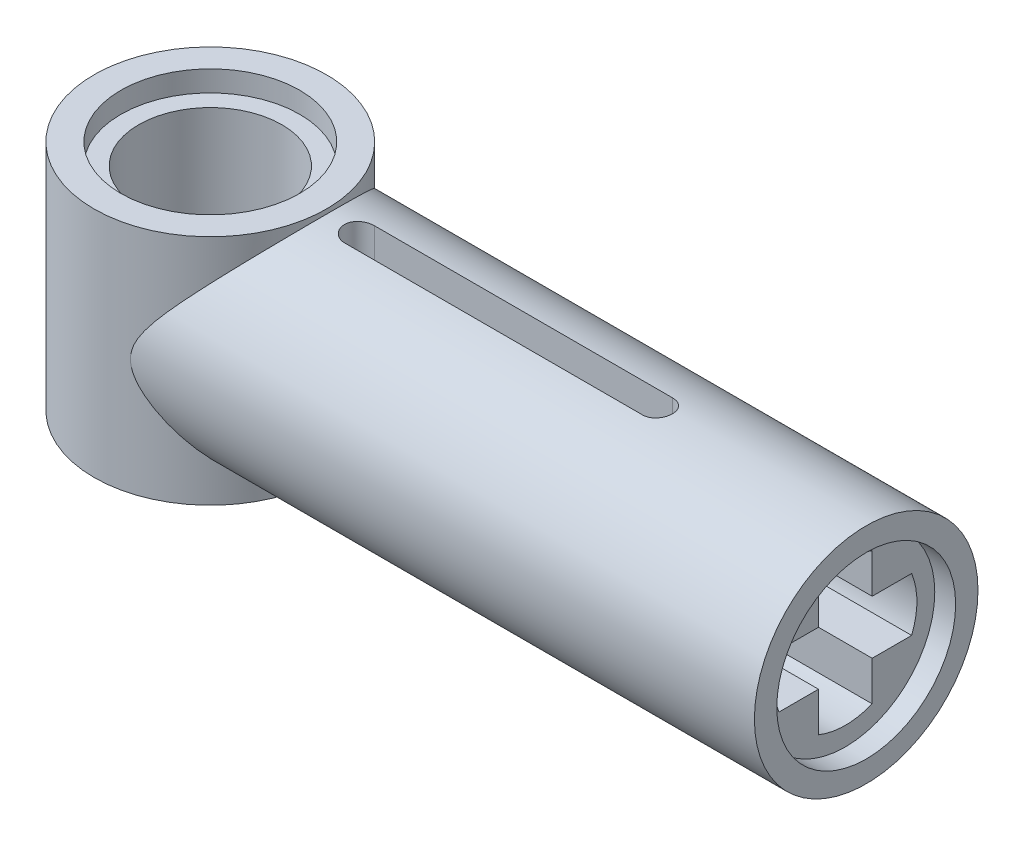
from build123d import *

# Parameters (mm, degrees)
SKETCH1_R                = 3.9
BOSS_EXTRUDE1_DEPTH      = 7.8
SKETCH2_R                = 3
CUT_EXTRUDE1_DEPTH       = 0.7
CUT_EXTRUDE2_START       = -0.7
SKETCH3_R                = 3
CUT_EXTRUDE2_DEPTH       = 0.7
SKETCH4_R                = 2.4
CUT_EXTRUDE3_DEPTH       = 10.553009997
BOSS_EXTRUDE2_REACH      = 29.329
BOSS_EXTRUDE2_END_RADIUS = 3.9
SKETCH6_R                = 3.75
CUT_EXTRUDE4_DEPTH       = 19
SKETCH8_R                = 3
CUT_EXTRUDE5_DEPTH       = 0.7
CUT_EXTRUDE6_DEPTH       = 8.7


with BuildPart() as part:
    # Sketch1 → Boss-Extrude1 (new body)
    with BuildSketch(Plane(origin=(0, 0, 0), x_dir=(1, 0, 0), z_dir=(0, 1, 0))):
        with Locations(Location((0, 0, 0), (0, 0, 270))):
            Circle(SKETCH1_R)
    extrude(amount=BOSS_EXTRUDE1_DEPTH)

    # Sketch2 → Cut-Extrude1 (cut)
    with BuildSketch(Plane(origin=(0, 7.8, 0), x_dir=(1, 0, 0), z_dir=(0, 1, 0))):
        with Locations(Location((0, 0, 0), (0, 0, 270))):
            Circle(SKETCH2_R)
    extrude(amount=-CUT_EXTRUDE1_DEPTH, mode=Mode.SUBTRACT)

    # Sketch3 → Cut-Extrude2 (cut)
    with BuildSketch(Plane.XZ.offset(CUT_EXTRUDE2_START)):
        with Locations(Location((0, 0, 0), (0, 0, 90))):
            Circle(SKETCH3_R)
    extrude(amount=CUT_EXTRUDE2_DEPTH, mode=Mode.SUBTRACT)

    # Sketch4 → Cut-Extrude3 (cut, through all)
    with BuildSketch(Plane.XZ):
        with Locations(Location((0, 0, 0), (0, 0, 270))):
            Circle(SKETCH4_R)
    extrude(amount=-CUT_EXTRUDE3_DEPTH, mode=Mode.SUBTRACT)

    # Boss-Extrude2: up to this cylinder (the profile starts outside it)
    boss_extrude2_end = Plane(origin=(0, 3.9, 0), z_dir=(0, -1, 0)) * Cylinder(BOSS_EXTRUDE2_END_RADIUS, 67.458, mode=Mode.PRIVATE)
    # Sketch6 → Boss-Extrude2 (add, up to the surface)
    with BuildSketch(Plane(origin=(22, 0, 0), x_dir=(0, 0, -1), z_dir=(1, 0, 0)), mode=Mode.PRIVATE) as boss_extrude2_sk1:
        with Locations((0, 3.9)):
            Circle(SKETCH6_R)
    boss_extrude2_tool1 = extrude(boss_extrude2_sk1.sketch, amount=-BOSS_EXTRUDE2_REACH, mode=Mode.PRIVATE) - boss_extrude2_end
    add(boss_extrude2_tool1.solids().sort_by_distance((22, 3.9, 0))[0])

    # Sketch7 → Cut-Extrude4 (cut)
    with BuildSketch(Plane(origin=(22, 0, 0), x_dir=(0, 0, -1), z_dir=(1, 0, 0))):
        with BuildLine():
            Line((-2.224859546, 4.8), (-0.9, 4.8))
            Line((-0.9, 4.8), (-0.9, 6.124859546))
            ThreePointArc((-0.9, 6.124859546), (0, 6.3), (0.9, 6.124859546))
            Line((0.9, 6.124859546), (0.9, 4.8))
            Line((0.9, 4.8), (2.224859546, 4.8))
            ThreePointArc((2.224859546, 4.8), (2.4, 3.9), (2.224859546, 3))
            Line((2.224859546, 3), (0.9, 3))
            Line((0.9, 3), (0.9, 1.675140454))
            ThreePointArc((0.9, 1.675140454), (0, 1.5), (-0.9, 1.675140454))
            Line((-0.9, 1.675140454), (-0.9, 3))
            Line((-0.9, 3), (-2.224859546, 3))
            ThreePointArc((-2.224859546, 3), (-2.4, 3.9), (-2.224859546, 4.8))
        make_face()
    extrude(amount=-CUT_EXTRUDE4_DEPTH, mode=Mode.SUBTRACT)

    # Sketch8 → Cut-Extrude5 (cut)
    with BuildSketch(Plane(origin=(22, 0, 0), x_dir=(0, 0, -1), z_dir=(1, 0, 0))):
        with Locations((0, 3.871353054)):
            Circle(SKETCH8_R)
    extrude(amount=-CUT_EXTRUDE5_DEPTH, mode=Mode.SUBTRACT)

    # Sketch9 → Cut-Extrude6 (cut)
    with BuildSketch(Plane(origin=(0, 0, 0), x_dir=(1, 0, 0), z_dir=(0, 1, 0))):
        with BuildLine():
            Line((5, 0.5), (15, 0.5))
            ThreePointArc((15, 0.5), (15.5, 0), (15, -0.5))
            Line((15, -0.5), (5, -0.5))
            ThreePointArc((5, -0.5), (4.5, 0), (5, 0.5))
        make_face()
    extrude(amount=CUT_EXTRUDE6_DEPTH, mode=Mode.SUBTRACT)


solid = part.part
